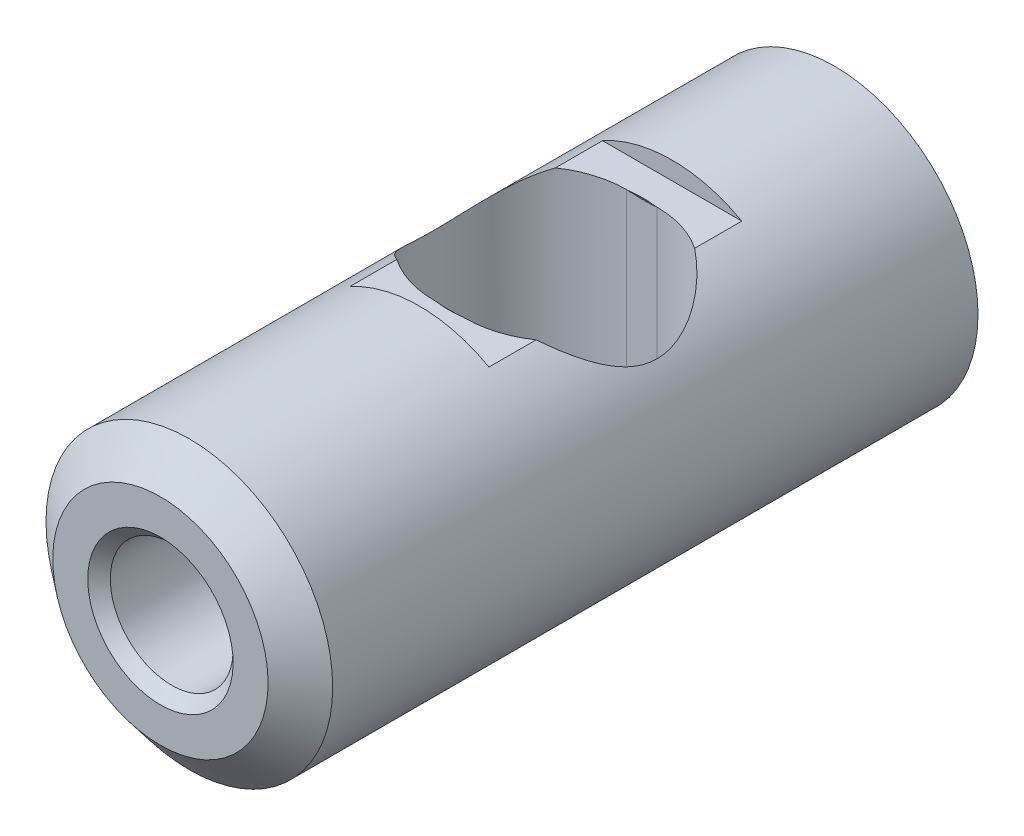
ISO-10303-21;
HEADER;
FILE_DESCRIPTION(('STEP AP214'),'2;1');
FILE_NAME('part.step','',(''),(''),'','','');
FILE_SCHEMA(('AUTOMOTIVE_DESIGN { 1 0 10303 214 1 1 1 1 }'));
ENDSEC;
DATA;
#1=APPLICATION_CONTEXT('core data for automotive mechanical design processes');
#2=APPLICATION_PROTOCOL_DEFINITION('international standard','automotive_design',2000,#1);
#3=PRODUCT_CONTEXT('',#1,'mechanical');
#4=PRODUCT('Part','Part','',(#3));
#5=PRODUCT_RELATED_PRODUCT_CATEGORY('part','',(#4));
#6=PRODUCT_DEFINITION_FORMATION('','',#4);
#7=PRODUCT_DEFINITION_CONTEXT('part definition',#1,'design');
#8=PRODUCT_DEFINITION('design','',#6,#7);
#9=PRODUCT_DEFINITION_SHAPE('','',#8);
#10=(LENGTH_UNIT() NAMED_UNIT(*) SI_UNIT(.MILLI.,.METRE.));
#11=(NAMED_UNIT(*) PLANE_ANGLE_UNIT() SI_UNIT($,.RADIAN.));
#12=(NAMED_UNIT(*) SI_UNIT($,.STERADIAN.) SOLID_ANGLE_UNIT());
#13=UNCERTAINTY_MEASURE_WITH_UNIT(LENGTH_MEASURE(1.E-05),#10,'distance_accuracy_value','');
#14=(GEOMETRIC_REPRESENTATION_CONTEXT(3) GLOBAL_UNCERTAINTY_ASSIGNED_CONTEXT((#13)) GLOBAL_UNIT_ASSIGNED_CONTEXT((#10,
#11,#12)) REPRESENTATION_CONTEXT('',''));
#15=CARTESIAN_POINT('',(0.,0.,0.));
#16=DIRECTION('',(0.,0.,1.));
#17=DIRECTION('',(1.,0.,0.));
#18=AXIS2_PLACEMENT_3D('',#15,#16,#17);
#19=CARTESIAN_POINT('',(0.,0.,-12.9999994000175));
#20=DIRECTION('',(0.,0.,1.));
#21=DIRECTION('',(0.,1.,0.));
#22=AXIS2_PLACEMENT_3D('',#19,#20,#21);
#23=CONICAL_SURFACE('',#22,3.39999999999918,1.02974425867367);
#24=CARTESIAN_POINT('',(0.,0.,-15.0429255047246));
#25=VERTEX_POINT('',#24);
#26=VERTEX_LOOP('',#25);
#27=FACE_BOUND('',#26,.T.);
#28=CARTESIAN_POINT('',(0.,0.,-12.9999994));
#29=DIRECTION('',(0.,0.,1.));
#30=DIRECTION('',(0.,1.,0.));
#31=AXIS2_PLACEMENT_3D('',#28,#29,#30);
#32=CIRCLE('',#31,3.4);
#33=CARTESIAN_POINT('',(0.,3.4,-12.9999994));
#34=VERTEX_POINT('',#33);
#35=EDGE_CURVE('E203',#34,#34,#32,.T.);
#36=ORIENTED_EDGE('',*,*,#35,.T.);
#37=EDGE_LOOP('',(#36));
#38=FACE_BOUND('',#37,.T.);
#39=ADVANCED_FACE('F14',(#27,#38),#23,.F.);
#40=CARTESIAN_POINT('',(0.,0.,0.));
#41=DIRECTION('',(0.,0.,1.));
#42=DIRECTION('',(0.,1.,0.));
#43=AXIS2_PLACEMENT_3D('',#40,#41,#42);
#44=CYLINDRICAL_SURFACE('',#43,3.4);
#45=ORIENTED_EDGE('',*,*,#35,.F.);
#46=EDGE_LOOP('',(#45));
#47=FACE_BOUND('',#46,.T.);
#48=CARTESIAN_POINT('',(0.,0.,-0.625000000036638));
#49=DIRECTION('',(0.,0.,1.));
#50=DIRECTION('',(0.,1.,0.));
#51=AXIS2_PLACEMENT_3D('',#48,#49,#50);
#52=CIRCLE('',#51,3.39999999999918);
#53=CARTESIAN_POINT('',(0.,3.39999999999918,-0.625000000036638));
#54=VERTEX_POINT('',#53);
#55=EDGE_CURVE('E200',#54,#54,#52,.T.);
#56=ORIENTED_EDGE('',*,*,#55,.T.);
#57=EDGE_LOOP('',(#56));
#58=FACE_BOUND('',#57,.T.);
#59=ADVANCED_FACE('F336',(#47,#58),#44,.F.);
#60=CARTESIAN_POINT('',(0.,0.,-2.29954943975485E-11));
#61=DIRECTION('',(0.,0.,1.));
#62=DIRECTION('',(0.,1.,0.));
#63=AXIS2_PLACEMENT_3D('',#60,#61,#62);
#64=CONICAL_SURFACE('',#63,4.02500000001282,0.785398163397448);
#65=ORIENTED_EDGE('',*,*,#55,.F.);
#66=EDGE_LOOP('',(#65));
#67=FACE_BOUND('',#66,.T.);
#68=CARTESIAN_POINT('',(0.,0.,-2.29954943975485E-11));
#69=DIRECTION('',(0.,0.,1.));
#70=DIRECTION('',(0.,1.,0.));
#71=AXIS2_PLACEMENT_3D('',#68,#69,#70);
#72=CIRCLE('',#71,4.02500000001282);
#73=CARTESIAN_POINT('',(0.,4.02500000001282,-2.29954943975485E-11));
#74=VERTEX_POINT('',#73);
#75=EDGE_CURVE('E17',#74,#74,#72,.T.);
#76=ORIENTED_EDGE('',*,*,#75,.T.);
#77=EDGE_LOOP('',(#76));
#78=FACE_BOUND('',#77,.T.);
#79=ADVANCED_FACE('F300',(#67,#78),#64,.F.);
#80=CARTESIAN_POINT('',(0.,6.92149999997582,-21.337999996));
#81=DIRECTION('',(0.,1.,0.));
#82=DIRECTION('',(0.,0.,-1.));
#83=AXIS2_PLACEMENT_3D('',#80,#81,#82);
#84=CONICAL_SURFACE('',#83,5.35787600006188,1.02974425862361);
#85=CARTESIAN_POINT('',(0.624981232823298,6.92149999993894,-16.016699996));
#86=CARTESIAN_POINT('',(0.416654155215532,6.90684861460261,-16.016699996));
#87=CARTESIAN_POINT('',(0.208327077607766,6.89952292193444,-16.016699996));
#88=CARTESIAN_POINT('',(-0.208327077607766,6.89952292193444,-16.016699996));
#89=CARTESIAN_POINT('',(-0.416654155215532,6.90684861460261,-16.016699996));
#90=CARTESIAN_POINT('',(-0.624981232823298,6.92149999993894,-16.016699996));
#91=B_SPLINE_CURVE_WITH_KNOTS('',3,(#85,#86,#87,#88,#89,#90),.UNSPECIFIED.,.F.,.F.,(4,2,4),(0.,
0.62536751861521,1.25073503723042),.UNSPECIFIED.);
#92=CARTESIAN_POINT('',(0.624981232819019,6.92149999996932,-16.016699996));
#93=VERTEX_POINT('',#92);
#94=CARTESIAN_POINT('',(-0.624981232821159,6.92149999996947,-16.016699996));
#95=VERTEX_POINT('',#94);
#96=EDGE_CURVE('E182',#93,#95,#91,.T.);
#97=ORIENTED_EDGE('',*,*,#96,.T.);
#98=CARTESIAN_POINT('',(0.,6.9215,-21.337999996));
#99=DIRECTION('',(0.,1.,0.));
#100=DIRECTION('',(-1.,0.,0.));
#101=AXIS2_PLACEMENT_3D('',#98,#99,#100);
#102=CIRCLE('',#101,5.357876);
#103=EDGE_CURVE('E195',#93,#95,#102,.F.);
#104=ORIENTED_EDGE('',*,*,#103,.F.);
#105=EDGE_LOOP('',(#97,#104));
#106=FACE_BOUND('',#105,.T.);
#107=ADVANCED_FACE('F295',(#106),#84,.F.);
#108=CARTESIAN_POINT('',(0.,7.9375,-21.337999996));
#109=DIRECTION('',(0.,1.,0.));
#110=DIRECTION('',(-1.,0.,0.));
#111=AXIS2_PLACEMENT_3D('',#108,#109,#110);
#112=CYLINDRICAL_SURFACE('',#111,5.357876);
#113=ORIENTED_EDGE('',*,*,#103,.T.);
#114=DIRECTION('',(0.,1.,0.));
#115=VECTOR('',#114,1.);
#116=CARTESIAN_POINT('',(-0.624981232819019,7.9375,-16.016699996));
#117=LINE('',#116,#115);
#118=CARTESIAN_POINT('',(-0.624981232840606,6.90649848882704,-16.016699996));
#119=VERTEX_POINT('',#118);
#120=EDGE_CURVE('E180',#95,#119,#117,.F.);
#121=ORIENTED_EDGE('',*,*,#120,.T.);
#122=CARTESIAN_POINT('',(0.,6.9064984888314,-21.337999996));
#123=DIRECTION('',(0.,1.,0.));
#124=DIRECTION('',(-1.,0.,0.));
#125=AXIS2_PLACEMENT_3D('',#122,#123,#124);
#126=CIRCLE('',#125,5.35787600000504);
#127=CARTESIAN_POINT('',(0.624981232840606,6.9064984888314,-16.016699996));
#128=VERTEX_POINT('',#127);
#129=EDGE_CURVE('E185',#119,#128,#126,.T.);
#130=ORIENTED_EDGE('',*,*,#129,.T.);
#131=DIRECTION('',(0.,1.,0.));
#132=VECTOR('',#131,1.);
#133=CARTESIAN_POINT('',(0.624981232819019,7.9375,-16.016699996));
#134=LINE('',#133,#132);
#135=EDGE_CURVE('E136',#128,#93,#134,.T.);
#136=ORIENTED_EDGE('',*,*,#135,.T.);
#137=EDGE_LOOP('',(#113,#121,#130,#136));
#138=FACE_BOUND('',#137,.T.);
#139=ADVANCED_FACE('F290',(#138),#112,.T.);
#140=CARTESIAN_POINT('',(0.,6.92149999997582,-21.337999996));
#141=DIRECTION('',(0.,1.,0.));
#142=DIRECTION('',(0.,0.,-1.));
#143=AXIS2_PLACEMENT_3D('',#140,#141,#142);
#144=CONICAL_SURFACE('',#143,5.35787600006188,1.02974425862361);
#145=CARTESIAN_POINT('',(-0.624981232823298,6.92149999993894,-26.659299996));
#146=CARTESIAN_POINT('',(-0.416654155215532,6.90684861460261,-26.659299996));
#147=CARTESIAN_POINT('',(-0.208327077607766,6.89952292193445,-26.659299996));
#148=CARTESIAN_POINT('',(0.208327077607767,6.89952292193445,-26.659299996));
#149=CARTESIAN_POINT('',(0.416654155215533,6.90684861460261,-26.659299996));
#150=CARTESIAN_POINT('',(0.624981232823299,6.92149999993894,-26.659299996));
#151=B_SPLINE_CURVE_WITH_KNOTS('',3,(#145,#146,#147,#148,#149,#150),.UNSPECIFIED.,.F.,.F.,(4,2,
4),(0.,0.62536751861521,1.25073503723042),.UNSPECIFIED.);
#152=CARTESIAN_POINT('',(-0.624981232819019,6.92149999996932,-26.659299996));
#153=VERTEX_POINT('',#152);
#154=CARTESIAN_POINT('',(0.624981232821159,6.92149999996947,-26.659299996));
#155=VERTEX_POINT('',#154);
#156=EDGE_CURVE('E170',#153,#155,#151,.T.);
#157=ORIENTED_EDGE('',*,*,#156,.T.);
#158=CARTESIAN_POINT('',(0.,6.9215,-21.337999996));
#159=DIRECTION('',(0.,1.,0.));
#160=DIRECTION('',(-1.,0.,0.));
#161=AXIS2_PLACEMENT_3D('',#158,#159,#160);
#162=CIRCLE('',#161,5.357876);
#163=EDGE_CURVE('E192',#153,#155,#162,.F.);
#164=ORIENTED_EDGE('',*,*,#163,.F.);
#165=EDGE_LOOP('',(#157,#164));
#166=FACE_BOUND('',#165,.T.);
#167=ADVANCED_FACE('F284',(#166),#144,.F.);
#168=CARTESIAN_POINT('',(0.,7.9375,-21.337999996));
#169=DIRECTION('',(0.,1.,0.));
#170=DIRECTION('',(-1.,0.,0.));
#171=AXIS2_PLACEMENT_3D('',#168,#169,#170);
#172=CYLINDRICAL_SURFACE('',#171,5.357876);
#173=ORIENTED_EDGE('',*,*,#163,.T.);
#174=DIRECTION('',(0.,-1.,0.));
#175=VECTOR('',#174,1.);
#176=CARTESIAN_POINT('',(0.624981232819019,7.9375,-26.659299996));
#177=LINE('',#176,#175);
#178=CARTESIAN_POINT('',(0.624981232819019,6.90649848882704,-26.659299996));
#179=VERTEX_POINT('',#178);
#180=EDGE_CURVE('E167',#155,#179,#177,.T.);
#181=ORIENTED_EDGE('',*,*,#180,.T.);
#182=CARTESIAN_POINT('',(0.,6.9064984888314,-21.337999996));
#183=DIRECTION('',(0.,1.,0.));
#184=DIRECTION('',(-1.,0.,0.));
#185=AXIS2_PLACEMENT_3D('',#182,#183,#184);
#186=CIRCLE('',#185,5.35787600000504);
#187=CARTESIAN_POINT('',(-0.624981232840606,6.90649848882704,-26.659299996));
#188=VERTEX_POINT('',#187);
#189=EDGE_CURVE('E189',#179,#188,#186,.T.);
#190=ORIENTED_EDGE('',*,*,#189,.T.);
#191=DIRECTION('',(0.,-1.,0.));
#192=VECTOR('',#191,1.);
#193=CARTESIAN_POINT('',(-0.624981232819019,7.9375,-26.659299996));
#194=LINE('',#193,#192);
#195=EDGE_CURVE('E171',#188,#153,#194,.F.);
#196=ORIENTED_EDGE('',*,*,#195,.T.);
#197=EDGE_LOOP('',(#173,#181,#190,#196));
#198=FACE_BOUND('',#197,.T.);
#199=ADVANCED_FACE('F289',(#198),#172,.T.);
#200=CARTESIAN_POINT('',(8.3312,-7.9375,0.));
#201=DIRECTION('',(0.,0.,-1.));
#202=DIRECTION('',(0.,-1.,0.));
#203=AXIS2_PLACEMENT_3D('',#200,#201,#202);
#204=PLANE('',#203);
#205=CARTESIAN_POINT('',(0.,0.,-1.36696209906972E-12));
#206=DIRECTION('',(0.,0.,-1.));
#207=DIRECTION('',(0.,-1.,0.));
#208=AXIS2_PLACEMENT_3D('',#205,#206,#207);
#209=CIRCLE('',#208,5.96069579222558);
#210=CARTESIAN_POINT('',(0.,-5.96069579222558,-1.36696209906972E-12));
#211=VERTEX_POINT('',#210);
#212=EDGE_CURVE('E149',#211,#211,#209,.T.);
#213=ORIENTED_EDGE('',*,*,#212,.F.);
#214=EDGE_LOOP('',(#213));
#215=FACE_BOUND('',#214,.T.);
#216=ORIENTED_EDGE('',*,*,#75,.F.);
#217=EDGE_LOOP('',(#216));
#218=FACE_BOUND('',#217,.T.);
#219=ADVANCED_FACE('F320',(#215,#218),#204,.F.);
#220=CARTESIAN_POINT('',(0.,6.93749999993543,-21.337999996));
#221=DIRECTION('',(0.,1.,0.));
#222=DIRECTION('',(0.,0.,-1.));
#223=AXIS2_PLACEMENT_3D('',#220,#221,#222);
#224=CONICAL_SURFACE('',#223,5.37577473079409,0.523598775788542);
#225=CARTESIAN_POINT('',(0.,6.93749999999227,-21.337999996));
#226=DIRECTION('',(0.,1.,0.));
#227=DIRECTION('',(0.,0.,-1.));
#228=AXIS2_PLACEMENT_3D('',#225,#226,#227);
#229=CIRCLE('',#228,5.37577473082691);
#230=CARTESIAN_POINT('',(-0.763361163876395,6.93749999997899,-16.016699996));
#231=VERTEX_POINT('',#230);
#232=CARTESIAN_POINT('',(0.763361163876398,6.93749999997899,-16.016699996));
#233=VERTEX_POINT('',#232);
#234=EDGE_CURVE('E115',#231,#233,#229,.T.);
#235=ORIENTED_EDGE('',*,*,#234,.T.);
#236=CARTESIAN_POINT('',(0.763361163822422,6.93749999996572,-16.016699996));
#237=CARTESIAN_POINT('',(0.740405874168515,6.93185088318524,-16.016699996));
#238=CARTESIAN_POINT('',(0.717396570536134,6.92644286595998,-16.016699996));
#239=CARTESIAN_POINT('',(0.671269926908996,6.91610902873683,-16.016699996));
#240=CARTESIAN_POINT('',(0.648152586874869,6.91118320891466,-16.016699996));
#241=CARTESIAN_POINT('',(0.624981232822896,6.90649848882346,-16.016699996));
#242=B_SPLINE_CURVE_WITH_KNOTS('',3,(#236,#237,#238,#239,#240,#241),.UNSPECIFIED.,.F.,.F.,(4,2,
4),(0.,0.0709089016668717,0.141817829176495),.UNSPECIFIED.);
#243=EDGE_CURVE('E119',#233,#128,#242,.T.);
#244=ORIENTED_EDGE('',*,*,#243,.T.);
#245=ORIENTED_EDGE('',*,*,#129,.F.);
#246=CARTESIAN_POINT('',(-0.624981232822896,6.90649848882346,-16.016699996));
#247=CARTESIAN_POINT('',(-0.648152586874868,6.91118320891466,-16.016699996));
#248=CARTESIAN_POINT('',(-0.671269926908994,6.91610902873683,-16.016699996));
#249=CARTESIAN_POINT('',(-0.717396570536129,6.92644286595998,-16.016699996));
#250=CARTESIAN_POINT('',(-0.740405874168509,6.93185088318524,-16.016699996));
#251=CARTESIAN_POINT('',(-0.763361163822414,6.93749999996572,-16.016699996));
#252=B_SPLINE_CURVE_WITH_KNOTS('',3,(#246,#247,#248,#249,#250,#251),.UNSPECIFIED.,.F.,.F.,(4,2,
4),(0.,0.0709089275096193,0.141817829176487),.UNSPECIFIED.);
#253=EDGE_CURVE('E122',#119,#231,#252,.T.);
#254=ORIENTED_EDGE('',*,*,#253,.T.);
#255=EDGE_LOOP('',(#235,#244,#245,#254));
#256=FACE_BOUND('',#255,.T.);
#257=ADVANCED_FACE('F117',(#256),#224,.F.);
#258=CARTESIAN_POINT('',(0.850347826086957,-2.199999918,-21.337999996));
#259=DIRECTION('',(0.,-1.,0.));
#260=DIRECTION('',(1.,0.,0.));
#261=AXIS2_PLACEMENT_3D('',#258,#259,#260);
#262=PLANE('',#261);
#263=DIRECTION('',(-1.,0.,0.));
#264=VECTOR('',#263,1.);
#265=CARTESIAN_POINT('',(0.850347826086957,-2.199999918,-26.659299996));
#266=LINE('',#265,#264);
#267=CARTESIAN_POINT('',(0.850347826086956,-2.199999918,-26.659299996));
#268=VERTEX_POINT('',#267);
#269=CARTESIAN_POINT('',(-0.850347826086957,-2.199999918,-26.659299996));
#270=VERTEX_POINT('',#269);
#271=EDGE_CURVE('E176',#268,#270,#266,.T.);
#272=ORIENTED_EDGE('',*,*,#271,.T.);
#273=CARTESIAN_POINT('',(-0.850347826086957,-2.199999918,-21.337999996));
#274=DIRECTION('',(0.,-1.,0.));
#275=DIRECTION('',(1.,0.,0.));
#276=AXIS2_PLACEMENT_3D('',#273,#274,#275);
#277=CIRCLE('',#276,5.3213);
#278=CARTESIAN_POINT('',(-0.850347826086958,-2.199999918,-16.016699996));
#279=VERTEX_POINT('',#278);
#280=EDGE_CURVE('E151',#270,#279,#277,.F.);
#281=ORIENTED_EDGE('',*,*,#280,.T.);
#282=DIRECTION('',(-1.,0.,0.));
#283=VECTOR('',#282,1.);
#284=CARTESIAN_POINT('',(0.850347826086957,-2.199999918,-16.016699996));
#285=LINE('',#284,#283);
#286=CARTESIAN_POINT('',(0.850347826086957,-2.199999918,-16.016699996));
#287=VERTEX_POINT('',#286);
#288=EDGE_CURVE('E137',#279,#287,#285,.F.);
#289=ORIENTED_EDGE('',*,*,#288,.T.);
#290=CARTESIAN_POINT('',(0.850347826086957,-2.199999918,-21.337999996));
#291=DIRECTION('',(0.,-1.,0.));
#292=DIRECTION('',(1.,0.,0.));
#293=AXIS2_PLACEMENT_3D('',#290,#291,#292);
#294=CIRCLE('',#293,5.3213);
#295=EDGE_CURVE('E187',#287,#268,#294,.F.);
#296=ORIENTED_EDGE('',*,*,#295,.T.);
#297=EDGE_LOOP('',(#272,#281,#289,#296));
#298=FACE_BOUND('',#297,.T.);
#299=ADVANCED_FACE('F313',(#298),#262,.F.);
#300=CARTESIAN_POINT('',(0.850347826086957,7.9375,-16.016699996));
#301=DIRECTION('',(0.,0.,1.));
#302=DIRECTION('',(0.,1.,0.));
#303=AXIS2_PLACEMENT_3D('',#300,#301,#302);
#304=PLANE('',#303);
#305=DIRECTION('',(1.,0.,0.));
#306=VECTOR('',#305,1.);
#307=CARTESIAN_POINT('',(7.9375,6.9375,-16.016699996));
#308=LINE('',#307,#306);
#309=CARTESIAN_POINT('',(-0.850347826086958,6.9375,-16.016699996));
#310=VERTEX_POINT('',#309);
#311=EDGE_CURVE('E128',#310,#231,#308,.T.);
#312=ORIENTED_EDGE('',*,*,#311,.T.);
#313=ORIENTED_EDGE('',*,*,#253,.F.);
#314=ORIENTED_EDGE('',*,*,#120,.F.);
#315=ORIENTED_EDGE('',*,*,#96,.F.);
#316=ORIENTED_EDGE('',*,*,#135,.F.);
#317=ORIENTED_EDGE('',*,*,#243,.F.);
#318=DIRECTION('',(1.,0.,0.));
#319=VECTOR('',#318,1.);
#320=CARTESIAN_POINT('',(7.9375,6.9375,-16.016699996));
#321=LINE('',#320,#319);
#322=CARTESIAN_POINT('',(0.850347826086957,6.9375,-16.016699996));
#323=VERTEX_POINT('',#322);
#324=EDGE_CURVE('E127',#233,#323,#321,.T.);
#325=ORIENTED_EDGE('',*,*,#324,.T.);
#326=DIRECTION('',(0.,-1.,0.));
#327=VECTOR('',#326,1.);
#328=CARTESIAN_POINT('',(0.850347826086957,7.9375,-16.016699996));
#329=LINE('',#328,#327);
#330=EDGE_CURVE('E165',#323,#287,#329,.T.);
#331=ORIENTED_EDGE('',*,*,#330,.T.);
#332=ORIENTED_EDGE('',*,*,#288,.F.);
#333=DIRECTION('',(0.,-1.,0.));
#334=VECTOR('',#333,1.);
#335=CARTESIAN_POINT('',(-0.850347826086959,7.9375,-16.016699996));
#336=LINE('',#335,#334);
#337=EDGE_CURVE('E178',#279,#310,#336,.F.);
#338=ORIENTED_EDGE('',*,*,#337,.T.);
#339=EDGE_LOOP('',(#312,#313,#314,#315,#316,#317,#325,#331,#332,#338));
#340=FACE_BOUND('',#339,.T.);
#341=ADVANCED_FACE('F131',(#340),#304,.F.);
#342=CARTESIAN_POINT('',(0.850347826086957,7.9375,-26.659299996));
#343=DIRECTION('',(0.,0.,-1.));
#344=DIRECTION('',(0.,-1.,0.));
#345=AXIS2_PLACEMENT_3D('',#342,#343,#344);
#346=PLANE('',#345);
#347=DIRECTION('',(-1.,0.,0.));
#348=VECTOR('',#347,1.);
#349=CARTESIAN_POINT('',(0.850347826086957,6.9375,-26.659299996));
#350=LINE('',#349,#348);
#351=CARTESIAN_POINT('',(0.763361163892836,6.93749999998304,-26.659299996));
#352=VERTEX_POINT('',#351);
#353=CARTESIAN_POINT('',(0.850347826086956,6.9375,-26.659299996));
#354=VERTEX_POINT('',#353);
#355=EDGE_CURVE('E169',#352,#354,#350,.F.);
#356=ORIENTED_EDGE('',*,*,#355,.F.);
#357=CARTESIAN_POINT('',(0.763361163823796,6.93749999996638,-26.6592999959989));
#358=CARTESIAN_POINT('',(0.740405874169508,6.93185088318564,-26.6592999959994));
#359=CARTESIAN_POINT('',(0.717396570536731,6.92644286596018,-26.6592999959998));
#360=CARTESIAN_POINT('',(0.671269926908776,6.91610902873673,-26.6592999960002));
#361=CARTESIAN_POINT('',(0.648152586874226,6.91118320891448,-26.6592999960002));
#362=CARTESIAN_POINT('',(0.624981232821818,6.90649848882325,-26.659299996));
#363=B_SPLINE_CURVE_WITH_KNOTS('',3,(#357,#358,#359,#360,#361,#362),.UNSPECIFIED.,.F.,.F.,(4,2,
4),(0.,0.0709089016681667,0.141817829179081),.UNSPECIFIED.);
#364=EDGE_CURVE('E166',#352,#179,#363,.T.);
#365=ORIENTED_EDGE('',*,*,#364,.T.);
#366=ORIENTED_EDGE('',*,*,#180,.F.);
#367=ORIENTED_EDGE('',*,*,#156,.F.);
#368=ORIENTED_EDGE('',*,*,#195,.F.);
#369=CARTESIAN_POINT('',(-0.624981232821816,6.90649848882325,-26.659299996));
#370=CARTESIAN_POINT('',(-0.648152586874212,6.91118320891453,-26.659299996));
#371=CARTESIAN_POINT('',(-0.671269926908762,6.91610902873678,-26.659299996));
#372=CARTESIAN_POINT('',(-0.71739657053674,6.92644286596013,-26.659299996));
#373=CARTESIAN_POINT('',(-0.74040587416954,6.93185088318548,-26.659299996));
#374=CARTESIAN_POINT('',(-0.763361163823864,6.93749999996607,-26.659299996));
#375=B_SPLINE_CURVE_WITH_KNOTS('',3,(#369,#370,#371,#372,#373,#374),.UNSPECIFIED.,.F.,.F.,(4,2,
4),(0.,0.0709089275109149,0.141817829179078),.UNSPECIFIED.);
#376=CARTESIAN_POINT('',(-0.763361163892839,6.93749999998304,-26.659299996));
#377=VERTEX_POINT('',#376);
#378=EDGE_CURVE('E191',#188,#377,#375,.T.);
#379=ORIENTED_EDGE('',*,*,#378,.T.);
#380=DIRECTION('',(-1.,0.,0.));
#381=VECTOR('',#380,1.);
#382=CARTESIAN_POINT('',(0.850347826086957,6.9375,-26.659299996));
#383=LINE('',#382,#381);
#384=CARTESIAN_POINT('',(-0.850347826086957,6.9375,-26.659299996));
#385=VERTEX_POINT('',#384);
#386=EDGE_CURVE('E174',#385,#377,#383,.F.);
#387=ORIENTED_EDGE('',*,*,#386,.F.);
#388=DIRECTION('',(0.,-1.,0.));
#389=VECTOR('',#388,1.);
#390=CARTESIAN_POINT('',(-0.850347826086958,7.9375,-26.659299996));
#391=LINE('',#390,#389);
#392=EDGE_CURVE('E157',#385,#270,#391,.T.);
#393=ORIENTED_EDGE('',*,*,#392,.T.);
#394=ORIENTED_EDGE('',*,*,#271,.F.);
#395=DIRECTION('',(0.,-1.,0.));
#396=VECTOR('',#395,1.);
#397=CARTESIAN_POINT('',(0.850347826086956,7.9375,-26.659299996));
#398=LINE('',#397,#396);
#399=EDGE_CURVE('E162',#268,#354,#398,.F.);
#400=ORIENTED_EDGE('',*,*,#399,.T.);
#401=EDGE_LOOP('',(#356,#365,#366,#367,#368,#379,#387,#393,#394,#400));
#402=FACE_BOUND('',#401,.T.);
#403=ADVANCED_FACE('F254',(#402),#346,.F.);
#404=CARTESIAN_POINT('',(0.,6.93749999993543,-21.337999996));
#405=DIRECTION('',(0.,1.,0.));
#406=DIRECTION('',(0.,0.,-1.));
#407=AXIS2_PLACEMENT_3D('',#404,#405,#406);
#408=CONICAL_SURFACE('',#407,5.37577473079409,0.523598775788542);
#409=CARTESIAN_POINT('',(0.,6.93749999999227,-21.337999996));
#410=DIRECTION('',(0.,1.,0.));
#411=DIRECTION('',(0.,0.,-1.));
#412=AXIS2_PLACEMENT_3D('',#409,#410,#411);
#413=CIRCLE('',#412,5.37577473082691);
#414=EDGE_CURVE('E374',#352,#377,#413,.T.);
#415=ORIENTED_EDGE('',*,*,#414,.T.);
#416=ORIENTED_EDGE('',*,*,#378,.F.);
#417=ORIENTED_EDGE('',*,*,#189,.F.);
#418=ORIENTED_EDGE('',*,*,#364,.F.);
#419=EDGE_LOOP('',(#415,#416,#417,#418));
#420=FACE_BOUND('',#419,.T.);
#421=ADVANCED_FACE('F248',(#420),#408,.F.);
#422=CARTESIAN_POINT('',(0.850347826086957,7.9375,-21.337999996));
#423=DIRECTION('',(0.,-1.,0.));
#424=DIRECTION('',(1.,0.,0.));
#425=AXIS2_PLACEMENT_3D('',#422,#423,#424);
#426=CYLINDRICAL_SURFACE('',#425,5.3213);
#427=CARTESIAN_POINT('',(3.85681215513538,6.9375,-25.7286042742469));
#428=CARTESIAN_POINT('',(3.99388811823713,6.86131547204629,-25.6347055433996));
#429=CARTESIAN_POINT('',(4.12563560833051,6.7827347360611,-25.5350963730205));
#430=CARTESIAN_POINT('',(4.37823980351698,6.62247798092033,-25.3251372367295));
#431=CARTESIAN_POINT('',(4.49909703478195,6.54080211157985,-25.2147877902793));
#432=CARTESIAN_POINT('',(4.73067532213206,6.37534781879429,-24.9830431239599));
#433=CARTESIAN_POINT('',(4.84130200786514,6.29155745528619,-24.8615623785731));
#434=CARTESIAN_POINT('',(5.05101717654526,6.12446631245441,-24.6087174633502));
#435=CARTESIAN_POINT('',(5.15010711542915,6.04116547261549,-24.4773545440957));
#436=CARTESIAN_POINT('',(5.31798357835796,5.89346053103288,-24.2317859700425));
#437=CARTESIAN_POINT('',(5.38889003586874,5.82857336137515,-24.1193151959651));
#438=CARTESIAN_POINT('',(5.52276878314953,5.70187879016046,-23.8880159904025));
#439=CARTESIAN_POINT('',(5.58573885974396,5.64007225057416,-23.769185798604));
#440=CARTESIAN_POINT('',(5.70310902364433,5.52135859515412,-23.5255014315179));
#441=CARTESIAN_POINT('',(5.75753435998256,5.46443727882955,-23.4006664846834));
#442=CARTESIAN_POINT('',(5.85742598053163,5.35722254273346,-23.144737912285));
#443=CARTESIAN_POINT('',(5.90289246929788,5.30692897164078,-23.0136444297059));
#444=CARTESIAN_POINT('',(6.0011511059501,5.19593033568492,-22.6889059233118));
#445=CARTESIAN_POINT('',(6.04901559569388,5.13970787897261,-22.492089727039));
#446=CARTESIAN_POINT('',(6.10396659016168,5.07408120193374,-22.1901718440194));
#447=CARTESIAN_POINT('',(6.11946808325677,5.05533392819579,-22.0885332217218));
#448=CARTESIAN_POINT('',(6.14461588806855,5.02473895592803,-21.8835231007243));
#449=CARTESIAN_POINT('',(6.15426586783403,5.01288693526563,-21.7801527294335));
#450=CARTESIAN_POINT('',(6.16446272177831,5.00033337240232,-21.6201247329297));
#451=CARTESIAN_POINT('',(6.16715478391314,4.99701083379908,-21.5637904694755));
#452=CARTESIAN_POINT('',(6.17074788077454,4.9925728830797,-21.4509745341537));
#453=CARTESIAN_POINT('',(6.17164876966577,4.99145765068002,-21.3944928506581));
#454=CARTESIAN_POINT('',(6.17164581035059,4.99146389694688,-21.2173161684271));
#455=CARTESIAN_POINT('',(6.16752815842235,4.99656675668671,-21.0965813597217));
#456=CARTESIAN_POINT('',(6.15118171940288,5.01667507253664,-20.8564326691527));
#457=CARTESIAN_POINT('',(6.13894586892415,5.03168915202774,-20.7370200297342));
#458=CARTESIAN_POINT('',(6.10666567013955,5.07081662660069,-20.5003403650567));
#459=CARTESIAN_POINT('',(6.08659336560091,5.09496258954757,-20.3830826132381));
#460=CARTESIAN_POINT('',(6.03912597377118,5.15113693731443,-20.1519325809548));
#461=CARTESIAN_POINT('',(6.01172539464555,5.18317123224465,-20.0380428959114));
#462=CARTESIAN_POINT('',(5.94379686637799,5.26102346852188,-19.7911982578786));
#463=CARTESIAN_POINT('',(5.90172826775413,5.30832116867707,-19.6591365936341));
#464=CARTESIAN_POINT('',(5.80854579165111,5.41012584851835,-19.4011650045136));
#465=CARTESIAN_POINT('',(5.75743030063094,5.46463411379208,-19.2752561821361));
#466=CARTESIAN_POINT('',(5.64666822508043,5.57901391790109,-19.0293701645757));
#467=CARTESIAN_POINT('',(5.58700053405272,5.63889858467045,-18.9094086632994));
#468=CARTESIAN_POINT('',(5.45969756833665,5.76224548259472,-18.6757001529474));
#469=CARTESIAN_POINT('',(5.3920600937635,5.82570869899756,-18.561954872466));
#470=CARTESIAN_POINT('',(5.22442189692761,5.97713140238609,-18.3023524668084));
#471=CARTESIAN_POINT('',(5.12132014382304,6.06596989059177,-18.1589997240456));
#472=CARTESIAN_POINT('',(4.90179417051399,6.24470858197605,-17.8835786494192));
#473=CARTESIAN_POINT('',(4.78536680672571,6.33460903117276,-17.7515129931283));
#474=CARTESIAN_POINT('',(4.54072611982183,6.51216560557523,-17.5003201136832));
#475=CARTESIAN_POINT('',(4.41264198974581,6.59983517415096,-17.3810769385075));
#476=CARTESIAN_POINT('',(4.14400879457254,6.7717523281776,-17.154848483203));
#477=CARTESIAN_POINT('',(4.00346109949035,6.85600028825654,-17.0478618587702));
#478=CARTESIAN_POINT('',(3.8568121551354,6.9375,-16.9473957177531));
#479=B_SPLINE_CURVE_WITH_KNOTS('',3,(#427,#428,#429,#430,#431,#432,#433,#434,#435,#436,#437,
#438,#439,#440,#441,#442,#443,#444,#445,#446,#447,#448,#449,#450,#451,#452,#453,#454,#455,#456,
#457,#458,#459,#460,#461,#462,#463,#464,#465,#466,#467,#468,#469,#470,#471,#472,#473,#474,#475,
#476,#477,#478),.UNSPECIFIED.,.F.,.F.,(4,2,2,2,2,2,2,2,2,2,2,2,2,2,2,2,2,2,2,2,2,2,2,2,2,4),(0.,
0.548086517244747,1.09614653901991,1.64884172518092,2.20146708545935,2.6449574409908,
3.08857119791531,3.53084838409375,3.97311547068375,4.60090740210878,4.91411029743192,
5.22711665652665,5.39654189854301,5.56598093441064,5.92794797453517,6.29023036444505,
6.65381716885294,7.01767721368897,7.45633162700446,7.89506435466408,8.33489912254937,
8.77485558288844,9.36701762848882,9.95931965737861,10.5457116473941,11.1320392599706),.UNSPECIFIED.);
#480=CARTESIAN_POINT('',(3.85681215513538,6.9375,-25.7286042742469));
#481=VERTEX_POINT('',#480);
#482=CARTESIAN_POINT('',(3.85681215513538,6.9375,-16.9473957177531));
#483=VERTEX_POINT('',#482);
#484=EDGE_CURVE('E231',#481,#483,#479,.T.);
#485=ORIENTED_EDGE('',*,*,#484,.F.);
#486=CARTESIAN_POINT('',(0.850347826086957,6.9375,-21.337999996));
#487=DIRECTION('',(0.,-1.,0.));
#488=DIRECTION('',(1.,0.,0.));
#489=AXIS2_PLACEMENT_3D('',#486,#487,#488);
#490=CIRCLE('',#489,5.3213);
#491=EDGE_CURVE('E160',#481,#354,#490,.F.);
#492=ORIENTED_EDGE('',*,*,#491,.T.);
#493=ORIENTED_EDGE('',*,*,#399,.F.);
#494=ORIENTED_EDGE('',*,*,#295,.F.);
#495=ORIENTED_EDGE('',*,*,#330,.F.);
#496=CARTESIAN_POINT('',(0.850347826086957,6.9375,-21.337999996));
#497=DIRECTION('',(0.,-1.,0.));
#498=DIRECTION('',(1.,0.,0.));
#499=AXIS2_PLACEMENT_3D('',#496,#497,#498);
#500=CIRCLE('',#499,5.3213);
#501=EDGE_CURVE('E141',#323,#483,#500,.F.);
#502=ORIENTED_EDGE('',*,*,#501,.T.);
#503=EDGE_LOOP('',(#485,#492,#493,#494,#495,#502));
#504=FACE_BOUND('',#503,.T.);
#505=ADVANCED_FACE('F242',(#504),#426,.F.);
#506=CARTESIAN_POINT('',(0.,0.,-1.60078448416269));
#507=DIRECTION('',(0.,0.,-1.));
#508=DIRECTION('',(0.,-1.,0.));
#509=AXIS2_PLACEMENT_3D('',#506,#507,#508);
#510=CONICAL_SURFACE('',#509,7.93749999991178,0.890117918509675);
#511=CARTESIAN_POINT('',(0.,0.,-1.60078448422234));
#512=DIRECTION('',(0.,0.,-1.));
#513=DIRECTION('',(0.,-1.,0.));
#514=AXIS2_PLACEMENT_3D('',#511,#512,#513);
#515=CIRCLE('',#514,7.9375);
#516=CARTESIAN_POINT('',(0.,-7.9375,-1.60078448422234));
#517=VERTEX_POINT('',#516);
#518=EDGE_CURVE('E152',#517,#517,#515,.T.);
#519=ORIENTED_EDGE('',*,*,#518,.F.);
#520=EDGE_LOOP('',(#519));
#521=FACE_BOUND('',#520,.T.);
#522=ORIENTED_EDGE('',*,*,#212,.T.);
#523=EDGE_LOOP('',(#522));
#524=FACE_BOUND('',#523,.T.);
#525=ADVANCED_FACE('F247',(#521,#524),#510,.T.);
#526=CARTESIAN_POINT('',(7.9375,7.9375,-14.337999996));
#527=DIRECTION('',(0.,0.,1.));
#528=DIRECTION('',(0.,1.,0.));
#529=AXIS2_PLACEMENT_3D('',#526,#527,#528);
#530=PLANE('',#529);
#531=DIRECTION('',(1.,0.,0.));
#532=VECTOR('',#531,1.);
#533=CARTESIAN_POINT('',(7.9375,6.9375,-14.337999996));
#534=LINE('',#533,#532);
#535=CARTESIAN_POINT('',(3.85681215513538,6.9375,-14.337999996));
#536=VERTEX_POINT('',#535);
#537=CARTESIAN_POINT('',(-3.85681215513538,6.9375,-14.337999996));
#538=VERTEX_POINT('',#537);
#539=EDGE_CURVE('E143',#536,#538,#534,.F.);
#540=ORIENTED_EDGE('',*,*,#539,.T.);
#541=CARTESIAN_POINT('',(0.,0.,-14.337999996));
#542=DIRECTION('',(0.,0.,-1.));
#543=DIRECTION('',(0.,-1.,0.));
#544=AXIS2_PLACEMENT_3D('',#541,#542,#543);
#545=CIRCLE('',#544,7.9375);
#546=EDGE_CURVE('E155',#536,#538,#545,.F.);
#547=ORIENTED_EDGE('',*,*,#546,.F.);
#548=EDGE_LOOP('',(#540,#547));
#549=FACE_BOUND('',#548,.T.);
#550=ADVANCED_FACE('F395',(#549),#530,.F.);
#551=CARTESIAN_POINT('',(7.9375,6.9375,-28.337999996));
#552=DIRECTION('',(0.,-1.,0.));
#553=DIRECTION('',(1.,0.,0.));
#554=AXIS2_PLACEMENT_3D('',#551,#552,#553);
#555=PLANE('',#554);
#556=DIRECTION('',(0.,0.,-1.));
#557=VECTOR('',#556,1.);
#558=CARTESIAN_POINT('',(3.85681215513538,6.9375,3.937));
#559=LINE('',#558,#557);
#560=EDGE_CURVE('E156',#483,#536,#559,.F.);
#561=ORIENTED_EDGE('',*,*,#560,.F.);
#562=ORIENTED_EDGE('',*,*,#501,.F.);
#563=ORIENTED_EDGE('',*,*,#324,.F.);
#564=ORIENTED_EDGE('',*,*,#234,.F.);
#565=ORIENTED_EDGE('',*,*,#311,.F.);
#566=CARTESIAN_POINT('',(-0.850347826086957,6.9375,-21.337999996));
#567=DIRECTION('',(0.,-1.,0.));
#568=DIRECTION('',(1.,0.,0.));
#569=AXIS2_PLACEMENT_3D('',#566,#567,#568);
#570=CIRCLE('',#569,5.3213);
#571=CARTESIAN_POINT('',(-3.85681215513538,6.9375,-16.9473957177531));
#572=VERTEX_POINT('',#571);
#573=EDGE_CURVE('E161',#310,#572,#570,.T.);
#574=ORIENTED_EDGE('',*,*,#573,.T.);
#575=DIRECTION('',(0.,0.,-1.));
#576=VECTOR('',#575,1.);
#577=CARTESIAN_POINT('',(-3.85681215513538,6.9375,3.937));
#578=LINE('',#577,#576);
#579=EDGE_CURVE('E217',#538,#572,#578,.T.);
#580=ORIENTED_EDGE('',*,*,#579,.F.);
#581=ORIENTED_EDGE('',*,*,#539,.F.);
#582=EDGE_LOOP('',(#561,#562,#563,#564,#565,#574,#580,#581));
#583=FACE_BOUND('',#582,.T.);
#584=ADVANCED_FACE('F140',(#583),#555,.F.);
#585=CARTESIAN_POINT('',(-0.850347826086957,7.9375,-21.337999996));
#586=DIRECTION('',(0.,-1.,0.));
#587=DIRECTION('',(1.,0.,0.));
#588=AXIS2_PLACEMENT_3D('',#585,#586,#587);
#589=CYLINDRICAL_SURFACE('',#588,5.3213);
#590=CARTESIAN_POINT('',(-0.850347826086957,6.9375,-21.337999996));
#591=DIRECTION('',(0.,-1.,0.));
#592=DIRECTION('',(1.,0.,0.));
#593=AXIS2_PLACEMENT_3D('',#590,#591,#592);
#594=CIRCLE('',#593,5.3213);
#595=CARTESIAN_POINT('',(-3.85681215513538,6.9375,-25.7286042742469));
#596=VERTEX_POINT('',#595);
#597=EDGE_CURVE('E240',#385,#596,#594,.F.);
#598=ORIENTED_EDGE('',*,*,#597,.T.);
#599=CARTESIAN_POINT('',(-3.85681215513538,6.9375,-16.9473957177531));
#600=CARTESIAN_POINT('',(-3.99388317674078,6.8613182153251,-17.0412910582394));
#601=CARTESIAN_POINT('',(-4.12562610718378,6.78274040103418,-17.1408964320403));
#602=CARTESIAN_POINT('',(-4.37822175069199,6.62248979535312,-17.3508470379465));
#603=CARTESIAN_POINT('',(-4.49907500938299,6.5408171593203,-17.4611917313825));
#604=CARTESIAN_POINT('',(-4.73065469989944,6.37536324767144,-17.6929346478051));
#605=CARTESIAN_POINT('',(-4.84128594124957,6.29156992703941,-17.814419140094));
#606=CARTESIAN_POINT('',(-5.05100967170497,6.12447262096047,-18.0672725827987));
#607=CARTESIAN_POINT('',(-5.15010358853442,6.04116857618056,-18.1986403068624));
#608=CARTESIAN_POINT('',(-5.3179952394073,5.89345027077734,-18.4442310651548));
#609=CARTESIAN_POINT('',(-5.38891216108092,5.82855311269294,-18.5567198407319));
#610=CARTESIAN_POINT('',(-5.52281176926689,5.70183742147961,-18.7880614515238));
#611=CARTESIAN_POINT('',(-5.58579195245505,5.64001986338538,-18.9069162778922));
#612=CARTESIAN_POINT('',(-5.70315779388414,5.52130795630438,-19.1506079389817));
#613=CARTESIAN_POINT('',(-5.75757170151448,5.46439771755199,-19.2754232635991));
#614=CARTESIAN_POINT('',(-5.85744275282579,5.35720402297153,-19.5313109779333));
#615=CARTESIAN_POINT('',(-5.90290025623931,5.30692030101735,-19.6623831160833));
#616=CARTESIAN_POINT('',(-6.00037201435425,5.19681026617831,-19.9845166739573));
#617=CARTESIAN_POINT('',(-6.04771874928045,5.14122983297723,-20.1785766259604));
#618=CARTESIAN_POINT('',(-6.10239908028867,5.07596573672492,-20.4763724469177));
#619=CARTESIAN_POINT('',(-6.11789979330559,5.05723245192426,-20.5767162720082));
#620=CARTESIAN_POINT('',(-6.14319908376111,5.02647119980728,-20.7791252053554));
#621=CARTESIAN_POINT('',(-6.15300011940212,5.01444034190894,-20.881189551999));
#622=CARTESIAN_POINT('',(-6.16673337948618,4.99754205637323,-21.0870177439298));
#623=CARTESIAN_POINT('',(-6.17062470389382,4.99272455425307,-21.1907884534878));
#624=CARTESIAN_POINT('',(-6.1723173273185,4.99063194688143,-21.3984545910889));
#625=CARTESIAN_POINT('',(-6.17011879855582,4.99335662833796,-21.5023500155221));
#626=CARTESIAN_POINT('',(-6.15968208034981,5.00622512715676,-21.7094268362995));
#627=CARTESIAN_POINT('',(-6.15144053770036,5.01637306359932,-21.8126078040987));
#628=CARTESIAN_POINT('',(-6.12909977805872,5.04364455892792,-22.0174379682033));
#629=CARTESIAN_POINT('',(-6.11499750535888,5.06077175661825,-22.1190863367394));
#630=CARTESIAN_POINT('',(-6.07833474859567,5.1047726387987,-22.337310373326));
#631=CARTESIAN_POINT('',(-6.0547424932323,5.13280978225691,-22.4534783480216));
#632=CARTESIAN_POINT('',(-6.00043459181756,5.1961945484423,-22.6821250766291));
#633=CARTESIAN_POINT('',(-5.96971377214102,5.23154747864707,-22.7946010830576));
#634=CARTESIAN_POINT('',(-5.86749512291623,5.34666977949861,-23.1263139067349));
#635=CARTESIAN_POINT('',(-5.78600937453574,5.43541584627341,-23.3394457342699));
#636=CARTESIAN_POINT('',(-5.62599434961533,5.600124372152,-23.6907865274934));
#637=CARTESIAN_POINT('',(-5.5530195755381,5.67271388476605,-23.8332707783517));
#638=CARTESIAN_POINT('',(-5.39574667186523,5.8225087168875,-24.1094288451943));
#639=CARTESIAN_POINT('',(-5.3114429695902,5.89971629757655,-24.2430982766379));
#640=CARTESIAN_POINT('',(-5.13211332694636,6.05635985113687,-24.5014536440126));
#641=CARTESIAN_POINT('',(-5.03709401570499,6.13579442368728,-24.6261450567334));
#642=CARTESIAN_POINT('',(-4.83663679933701,6.2950166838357,-24.8664839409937));
#643=CARTESIAN_POINT('',(-4.73120364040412,6.37480419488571,-24.9821354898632));
#644=CARTESIAN_POINT('',(-4.50434837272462,6.53721545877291,-25.2099101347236));
#645=CARTESIAN_POINT('',(-4.38238086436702,6.61977196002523,-25.3215399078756));
#646=CARTESIAN_POINT('',(-4.12766342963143,6.781525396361,-25.5335618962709));
#647=CARTESIAN_POINT('',(-3.99494218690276,6.86073046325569,-25.6339824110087));
#648=CARTESIAN_POINT('',(-3.85681215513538,6.9375,-25.7286042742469));
#649=B_SPLINE_CURVE_WITH_KNOTS('',3,(#599,#600,#601,#602,#603,#604,#605,#606,#607,#608,#609,
#610,#611,#612,#613,#614,#615,#616,#617,#618,#619,#620,#621,#622,#623,#624,#625,#626,#627,#628,
#629,#630,#631,#632,#633,#634,#635,#636,#637,#638,#639,#640,#641,#642,#643,#644,#645,#646,#647,
#648),.UNSPECIFIED.,.F.,.F.,(4,2,2,2,2,2,2,2,2,2,2,2,2,2,2,2,2,2,2,2,2,2,2,2,4),(0.,
0.548066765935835,1.09610605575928,1.6488208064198,2.2014670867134,2.64502662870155,
3.08872572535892,3.53092949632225,3.97311550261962,4.59242816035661,4.90185123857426,
5.21114076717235,5.52256123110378,5.83397288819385,6.14555747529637,6.45730472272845,
6.822170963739,7.18730284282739,7.9187670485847,8.44552702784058,8.9725470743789,
9.4992428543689,10.0256996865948,10.5794347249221,11.1317385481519),.UNSPECIFIED.);
#650=EDGE_CURVE('E208',#572,#596,#649,.T.);
#651=ORIENTED_EDGE('',*,*,#650,.F.);
#652=ORIENTED_EDGE('',*,*,#573,.F.);
#653=ORIENTED_EDGE('',*,*,#337,.F.);
#654=ORIENTED_EDGE('',*,*,#280,.F.);
#655=ORIENTED_EDGE('',*,*,#392,.F.);
#656=EDGE_LOOP('',(#598,#651,#652,#653,#654,#655));
#657=FACE_BOUND('',#656,.T.);
#658=ADVANCED_FACE('F219',(#657),#589,.F.);
#659=CARTESIAN_POINT('',(7.9375,6.9375,-28.337999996));
#660=DIRECTION('',(0.,-1.,0.));
#661=DIRECTION('',(1.,0.,0.));
#662=AXIS2_PLACEMENT_3D('',#659,#660,#661);
#663=PLANE('',#662);
#664=DIRECTION('',(0.,0.,-1.));
#665=VECTOR('',#664,1.);
#666=CARTESIAN_POINT('',(-3.85681215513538,6.9375,3.937));
#667=LINE('',#666,#665);
#668=CARTESIAN_POINT('',(-3.85681215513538,6.9375,-28.337999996));
#669=VERTEX_POINT('',#668);
#670=EDGE_CURVE('E207',#596,#669,#667,.T.);
#671=ORIENTED_EDGE('',*,*,#670,.F.);
#672=ORIENTED_EDGE('',*,*,#597,.F.);
#673=ORIENTED_EDGE('',*,*,#386,.T.);
#674=ORIENTED_EDGE('',*,*,#414,.F.);
#675=ORIENTED_EDGE('',*,*,#355,.T.);
#676=ORIENTED_EDGE('',*,*,#491,.F.);
#677=DIRECTION('',(0.,0.,-1.));
#678=VECTOR('',#677,1.);
#679=CARTESIAN_POINT('',(3.85681215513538,6.9375,3.937));
#680=LINE('',#679,#678);
#681=CARTESIAN_POINT('',(3.85681215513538,6.9375,-28.337999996));
#682=VERTEX_POINT('',#681);
#683=EDGE_CURVE('E239',#682,#481,#680,.F.);
#684=ORIENTED_EDGE('',*,*,#683,.F.);
#685=DIRECTION('',(-1.,0.,0.));
#686=VECTOR('',#685,1.);
#687=CARTESIAN_POINT('',(7.9375,6.9375,-28.337999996));
#688=LINE('',#687,#686);
#689=EDGE_CURVE('E32',#682,#669,#688,.T.);
#690=ORIENTED_EDGE('',*,*,#689,.T.);
#691=EDGE_LOOP('',(#671,#672,#673,#674,#675,#676,#684,#690));
#692=FACE_BOUND('',#691,.T.);
#693=ADVANCED_FACE('F386',(#692),#663,.F.);
#694=CARTESIAN_POINT('',(7.9375,7.9375,-28.337999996));
#695=DIRECTION('',(0.,0.,-1.));
#696=DIRECTION('',(0.,-1.,0.));
#697=AXIS2_PLACEMENT_3D('',#694,#695,#696);
#698=PLANE('',#697);
#699=ORIENTED_EDGE('',*,*,#689,.F.);
#700=CARTESIAN_POINT('',(0.,0.,-28.337999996));
#701=DIRECTION('',(0.,0.,-1.));
#702=DIRECTION('',(0.,-1.,0.));
#703=AXIS2_PLACEMENT_3D('',#700,#701,#702);
#704=CIRCLE('',#703,7.9375);
#705=EDGE_CURVE('E23',#669,#682,#704,.T.);
#706=ORIENTED_EDGE('',*,*,#705,.F.);
#707=EDGE_LOOP('',(#699,#706));
#708=FACE_BOUND('',#707,.T.);
#709=ADVANCED_FACE('F558',(#708),#698,.F.);
#710=CARTESIAN_POINT('',(0.,0.,-37.338));
#711=DIRECTION('',(0.,0.,1.));
#712=DIRECTION('',(0.,1.,0.));
#713=AXIS2_PLACEMENT_3D('',#710,#711,#712);
#714=PLANE('',#713);
#715=CARTESIAN_POINT('',(0.,0.,-37.338));
#716=DIRECTION('',(0.,0.,-1.));
#717=DIRECTION('',(0.,-1.,0.));
#718=AXIS2_PLACEMENT_3D('',#715,#716,#717);
#719=CIRCLE('',#718,7.9375);
#720=CARTESIAN_POINT('',(0.,-7.9375,-37.338));
#721=VERTEX_POINT('',#720);
#722=EDGE_CURVE('E9',#721,#721,#719,.F.);
#723=ORIENTED_EDGE('',*,*,#722,.F.);
#724=EDGE_LOOP('',(#723));
#725=FACE_BOUND('',#724,.T.);
#726=ADVANCED_FACE('F227',(#725),#714,.F.);
#727=CARTESIAN_POINT('',(0.,0.,3.937));
#728=DIRECTION('',(0.,0.,-1.));
#729=DIRECTION('',(0.,-1.,0.));
#730=AXIS2_PLACEMENT_3D('',#727,#728,#729);
#731=CYLINDRICAL_SURFACE('',#730,7.9375);
#732=ORIENTED_EDGE('',*,*,#560,.T.);
#733=ORIENTED_EDGE('',*,*,#546,.T.);
#734=ORIENTED_EDGE('',*,*,#579,.T.);
#735=ORIENTED_EDGE('',*,*,#650,.T.);
#736=ORIENTED_EDGE('',*,*,#670,.T.);
#737=ORIENTED_EDGE('',*,*,#705,.T.);
#738=ORIENTED_EDGE('',*,*,#683,.T.);
#739=ORIENTED_EDGE('',*,*,#484,.T.);
#740=EDGE_LOOP('',(#732,#733,#734,#735,#736,#737,#738,#739));
#741=FACE_BOUND('',#740,.T.);
#742=ORIENTED_EDGE('',*,*,#722,.T.);
#743=EDGE_LOOP('',(#742));
#744=FACE_BOUND('',#743,.T.);
#745=ORIENTED_EDGE('',*,*,#518,.T.);
#746=EDGE_LOOP('',(#745));
#747=FACE_BOUND('',#746,.T.);
#748=ADVANCED_FACE('F223',(#741,#744,#747),#731,.T.);
#749=CLOSED_SHELL('',(#39,#59,#79,#107,#139,#167,#199,#219,#257,#299,#341,#403,#421,#505,#525,
#550,#584,#658,#693,#709,#726,#748));
#750=MANIFOLD_SOLID_BREP('B1',#749);
#751=ADVANCED_BREP_SHAPE_REPRESENTATION('',(#18,#750),#14);
#752=SHAPE_DEFINITION_REPRESENTATION(#9,#751);
ENDSEC;
END-ISO-10303-21;
